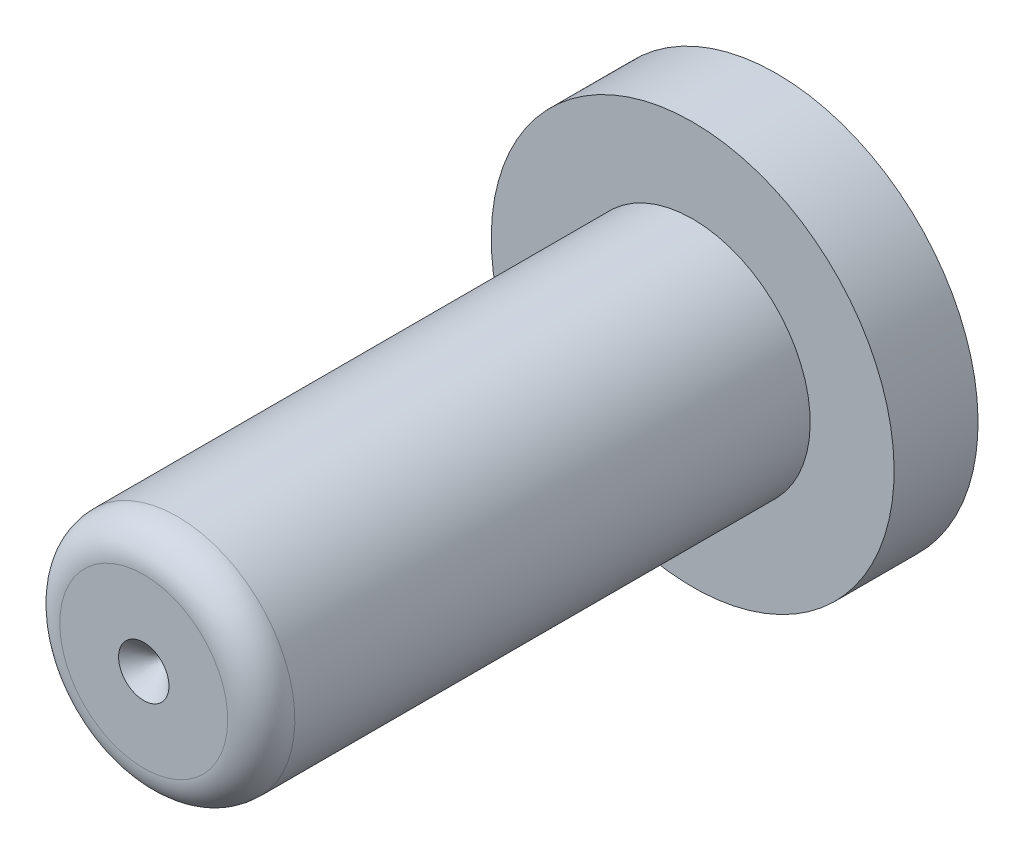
from build123d import *


with BuildPart() as part:
    # Sketch1 → Revolve1 (revolve)
    with BuildSketch(Plane(origin=(0, 0, 0), x_dir=(0, 0, -1), z_dir=(1, 0, 0))):
        with BuildLine():
            Line((0, 0), (0, 12))
            Line((0, 12), (-5, 12))
            Line((-5, 12), (-5, 7))
            Line((-5, 7), (-35.7, 7))
            ThreePointArc((-35.7, 7), (-37.114213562, 6.414213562), (-37.7, 5))
            Line((-37.7, 5), (-37.7, 1.5))
            Line((-37.7, 1.5), (-36.2, 0))
            Line((-36.2, 0), (0, 0))
        make_face()
    revolve(axis=Axis((0, 0, 0), (0, 0, 1)))


solid = part.part
